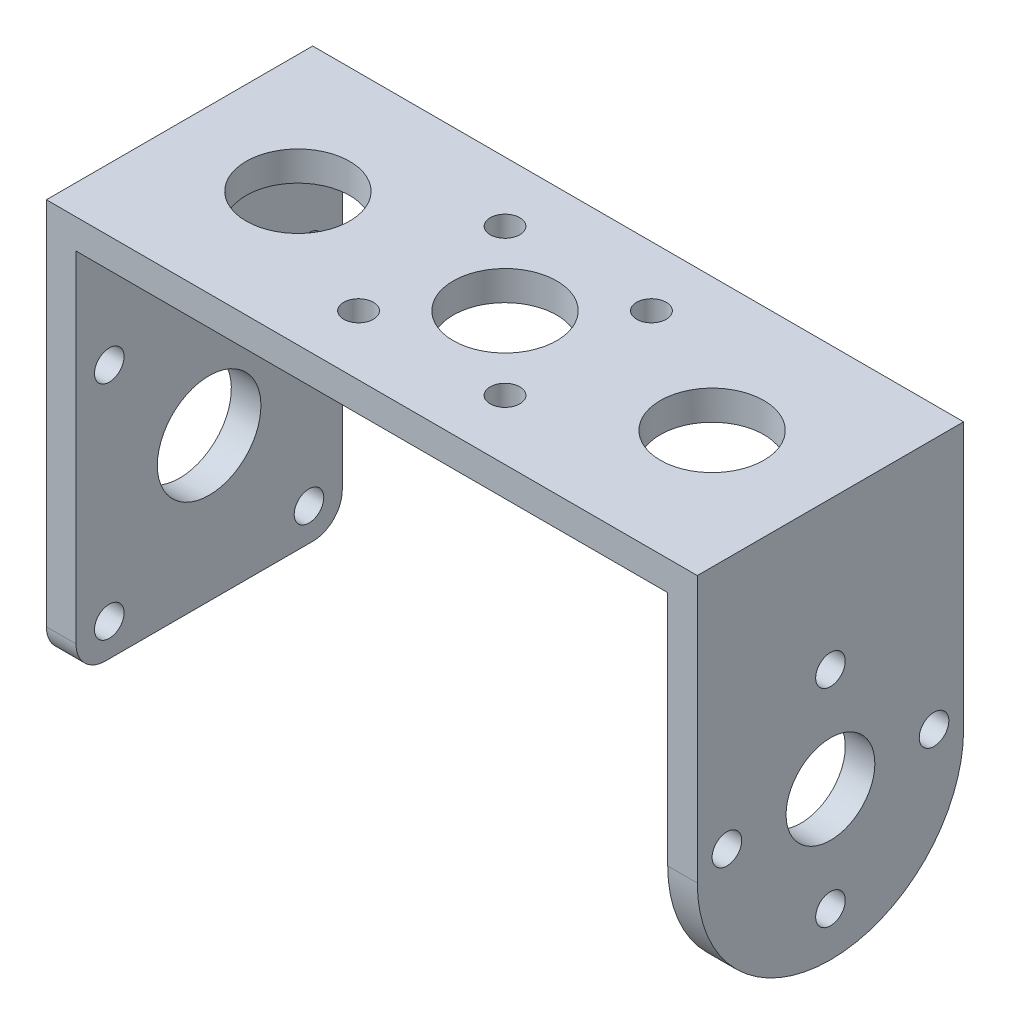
ISO-10303-21;
HEADER;
FILE_DESCRIPTION(('STEP AP214'),'2;1');
FILE_NAME('part.step','',(''),(''),'','','');
FILE_SCHEMA(('AUTOMOTIVE_DESIGN { 1 0 10303 214 1 1 1 1 }'));
ENDSEC;
DATA;
#1=APPLICATION_CONTEXT('core data for automotive mechanical design processes');
#2=APPLICATION_PROTOCOL_DEFINITION('international standard','automotive_design',2000,#1);
#3=PRODUCT_CONTEXT('',#1,'mechanical');
#4=PRODUCT('Part','Part','',(#3));
#5=PRODUCT_RELATED_PRODUCT_CATEGORY('part','',(#4));
#6=PRODUCT_DEFINITION_FORMATION('','',#4);
#7=PRODUCT_DEFINITION_CONTEXT('part definition',#1,'design');
#8=PRODUCT_DEFINITION('design','',#6,#7);
#9=PRODUCT_DEFINITION_SHAPE('','',#8);
#10=(LENGTH_UNIT() NAMED_UNIT(*) SI_UNIT(.MILLI.,.METRE.));
#11=(NAMED_UNIT(*) PLANE_ANGLE_UNIT() SI_UNIT($,.RADIAN.));
#12=(NAMED_UNIT(*) SI_UNIT($,.STERADIAN.) SOLID_ANGLE_UNIT());
#13=UNCERTAINTY_MEASURE_WITH_UNIT(LENGTH_MEASURE(1.E-05),#10,'distance_accuracy_value','');
#14=(GEOMETRIC_REPRESENTATION_CONTEXT(3) GLOBAL_UNCERTAINTY_ASSIGNED_CONTEXT((#13)) GLOBAL_UNIT_ASSIGNED_CONTEXT((#10,
#11,#12)) REPRESENTATION_CONTEXT('',''));
#15=CARTESIAN_POINT('',(0.,0.,0.));
#16=DIRECTION('',(0.,0.,1.));
#17=DIRECTION('',(1.,0.,0.));
#18=AXIS2_PLACEMENT_3D('',#15,#16,#17);
#19=CARTESIAN_POINT('',(22.,13.5,18.));
#20=DIRECTION('',(-1.,0.,0.));
#21=DIRECTION('',(0.,-1.,0.));
#22=AXIS2_PLACEMENT_3D('',#19,#20,#21);
#23=PLANE('',#22);
#24=CARTESIAN_POINT('',(22.,-3.50000000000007,2.));
#25=DIRECTION('',(1.,0.,0.));
#26=DIRECTION('',(0.,1.,0.));
#27=AXIS2_PLACEMENT_3D('',#24,#25,#26);
#28=CIRCLE('',#27,1.);
#29=CARTESIAN_POINT('',(22.,-2.50000000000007,2.));
#30=VERTEX_POINT('',#29);
#31=EDGE_CURVE('E277',#30,#30,#28,.T.);
#32=ORIENTED_EDGE('',*,*,#31,.F.);
#33=EDGE_LOOP('',(#32));
#34=FACE_BOUND('',#33,.T.);
#35=CARTESIAN_POINT('',(22.,3.5,8.99999999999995));
#36=DIRECTION('',(1.,0.,0.));
#37=DIRECTION('',(0.,1.,0.));
#38=AXIS2_PLACEMENT_3D('',#35,#36,#37);
#39=CIRCLE('',#38,1.);
#40=CARTESIAN_POINT('',(22.,4.5,8.99999999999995));
#41=VERTEX_POINT('',#40);
#42=EDGE_CURVE('E283',#41,#41,#39,.T.);
#43=ORIENTED_EDGE('',*,*,#42,.F.);
#44=EDGE_LOOP('',(#43));
#45=FACE_BOUND('',#44,.T.);
#46=CARTESIAN_POINT('',(22.,-3.49999999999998,16.));
#47=DIRECTION('',(1.,0.,0.));
#48=DIRECTION('',(0.,1.,0.));
#49=AXIS2_PLACEMENT_3D('',#46,#47,#48);
#50=CIRCLE('',#49,1.);
#51=CARTESIAN_POINT('',(22.,-2.49999999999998,16.));
#52=VERTEX_POINT('',#51);
#53=EDGE_CURVE('E289',#52,#52,#50,.T.);
#54=ORIENTED_EDGE('',*,*,#53,.F.);
#55=EDGE_LOOP('',(#54));
#56=FACE_BOUND('',#55,.T.);
#57=CARTESIAN_POINT('',(22.,-10.5,9.));
#58=DIRECTION('',(1.,0.,0.));
#59=DIRECTION('',(0.,1.,0.));
#60=AXIS2_PLACEMENT_3D('',#57,#58,#59);
#61=CIRCLE('',#60,1.);
#62=CARTESIAN_POINT('',(22.,-9.5,9.));
#63=VERTEX_POINT('',#62);
#64=EDGE_CURVE('E295',#63,#63,#61,.T.);
#65=ORIENTED_EDGE('',*,*,#64,.F.);
#66=EDGE_LOOP('',(#65));
#67=FACE_BOUND('',#66,.T.);
#68=CARTESIAN_POINT('',(22.,-3.5,9.));
#69=DIRECTION('',(1.,0.,0.));
#70=DIRECTION('',(0.,1.,0.));
#71=AXIS2_PLACEMENT_3D('',#68,#69,#70);
#72=CIRCLE('',#71,3.);
#73=CARTESIAN_POINT('',(22.,-0.499999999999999,9.));
#74=VERTEX_POINT('',#73);
#75=EDGE_CURVE('E201',#74,#74,#72,.T.);
#76=ORIENTED_EDGE('',*,*,#75,.F.);
#77=EDGE_LOOP('',(#76));
#78=FACE_BOUND('',#77,.T.);
#79=CARTESIAN_POINT('',(22.,-4.5,9.));
#80=DIRECTION('',(-1.,0.,0.));
#81=DIRECTION('',(0.,-1.,0.));
#82=AXIS2_PLACEMENT_3D('',#79,#80,#81);
#83=CIRCLE('',#82,9.);
#84=CARTESIAN_POINT('',(22.,-4.5,18.));
#85=VERTEX_POINT('',#84);
#86=CARTESIAN_POINT('',(22.,-13.5,9.));
#87=VERTEX_POINT('',#86);
#88=EDGE_CURVE('E146',#85,#87,#83,.F.);
#89=ORIENTED_EDGE('',*,*,#88,.T.);
#90=CARTESIAN_POINT('',(22.,-4.5,9.));
#91=DIRECTION('',(-1.,0.,0.));
#92=DIRECTION('',(0.,-1.,0.));
#93=AXIS2_PLACEMENT_3D('',#90,#91,#92);
#94=CIRCLE('',#93,9.);
#95=CARTESIAN_POINT('',(22.,-4.5,0.));
#96=VERTEX_POINT('',#95);
#97=EDGE_CURVE('E188',#87,#96,#94,.F.);
#98=ORIENTED_EDGE('',*,*,#97,.T.);
#99=DIRECTION('',(0.,1.,0.));
#100=VECTOR('',#99,1.);
#101=CARTESIAN_POINT('',(22.,13.5,0.));
#102=LINE('',#101,#100);
#103=CARTESIAN_POINT('',(22.,13.5,0.));
#104=VERTEX_POINT('',#103);
#105=EDGE_CURVE('E143',#96,#104,#102,.T.);
#106=ORIENTED_EDGE('',*,*,#105,.T.);
#107=DIRECTION('',(0.,0.,-1.));
#108=VECTOR('',#107,1.);
#109=CARTESIAN_POINT('',(22.,13.5,18.));
#110=LINE('',#109,#108);
#111=CARTESIAN_POINT('',(22.,13.5,18.));
#112=VERTEX_POINT('',#111);
#113=EDGE_CURVE('E141',#112,#104,#110,.T.);
#114=ORIENTED_EDGE('',*,*,#113,.F.);
#115=DIRECTION('',(0.,1.,0.));
#116=VECTOR('',#115,1.);
#117=CARTESIAN_POINT('',(22.,13.5,18.));
#118=LINE('',#117,#116);
#119=EDGE_CURVE('E127',#85,#112,#118,.T.);
#120=ORIENTED_EDGE('',*,*,#119,.F.);
#121=EDGE_LOOP('',(#89,#98,#106,#114,#120));
#122=FACE_BOUND('',#121,.T.);
#123=ADVANCED_FACE('F39',(#34,#45,#56,#67,#78,#122),#23,.F.);
#124=CARTESIAN_POINT('',(-22.,13.5,18.));
#125=DIRECTION('',(0.,-1.,0.));
#126=DIRECTION('',(0.,0.,-1.));
#127=AXIS2_PLACEMENT_3D('',#124,#125,#126);
#128=PLANE('',#127);
#129=CARTESIAN_POINT('',(14.,13.5,9.));
#130=DIRECTION('',(0.,1.,0.));
#131=DIRECTION('',(0.,0.,-1.));
#132=AXIS2_PLACEMENT_3D('',#129,#130,#131);
#133=CIRCLE('',#132,3.5);
#134=CARTESIAN_POINT('',(14.,13.5,5.5));
#135=VERTEX_POINT('',#134);
#136=EDGE_CURVE('E576',#135,#135,#133,.T.);
#137=ORIENTED_EDGE('',*,*,#136,.F.);
#138=EDGE_LOOP('',(#137));
#139=FACE_BOUND('',#138,.T.);
#140=CARTESIAN_POINT('',(-14.,13.5,9.));
#141=DIRECTION('',(0.,1.,0.));
#142=DIRECTION('',(0.,0.,1.));
#143=AXIS2_PLACEMENT_3D('',#140,#141,#142);
#144=CIRCLE('',#143,3.5);
#145=CARTESIAN_POINT('',(-14.,13.5,12.5));
#146=VERTEX_POINT('',#145);
#147=EDGE_CURVE('E580',#146,#146,#144,.T.);
#148=ORIENTED_EDGE('',*,*,#147,.F.);
#149=EDGE_LOOP('',(#148));
#150=FACE_BOUND('',#149,.T.);
#151=CARTESIAN_POINT('',(4.94974746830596,13.5,13.9497474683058));
#152=DIRECTION('',(0.,1.,0.));
#153=DIRECTION('',(0.,0.,1.));
#154=AXIS2_PLACEMENT_3D('',#151,#152,#153);
#155=CIRCLE('',#154,1.);
#156=CARTESIAN_POINT('',(4.94974746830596,13.5,14.9497474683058));
#157=VERTEX_POINT('',#156);
#158=EDGE_CURVE('E237',#157,#157,#155,.T.);
#159=ORIENTED_EDGE('',*,*,#158,.F.);
#160=EDGE_LOOP('',(#159));
#161=FACE_BOUND('',#160,.T.);
#162=CARTESIAN_POINT('',(-4.94974746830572,13.5,13.9497474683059));
#163=DIRECTION('',(0.,1.,0.));
#164=DIRECTION('',(0.,0.,1.));
#165=AXIS2_PLACEMENT_3D('',#162,#163,#164);
#166=CIRCLE('',#165,1.);
#167=CARTESIAN_POINT('',(-4.94974746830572,13.5,14.9497474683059));
#168=VERTEX_POINT('',#167);
#169=EDGE_CURVE('E227',#168,#168,#166,.T.);
#170=ORIENTED_EDGE('',*,*,#169,.F.);
#171=EDGE_LOOP('',(#170));
#172=FACE_BOUND('',#171,.T.);
#173=CARTESIAN_POINT('',(-4.94974746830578,13.5,4.05025253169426));
#174=DIRECTION('',(0.,1.,0.));
#175=DIRECTION('',(0.,0.,1.));
#176=AXIS2_PLACEMENT_3D('',#173,#174,#175);
#177=CIRCLE('',#176,1.);
#178=CARTESIAN_POINT('',(-4.94974746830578,13.5,5.05025253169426));
#179=VERTEX_POINT('',#178);
#180=EDGE_CURVE('E224',#179,#179,#177,.T.);
#181=ORIENTED_EDGE('',*,*,#180,.F.);
#182=EDGE_LOOP('',(#181));
#183=FACE_BOUND('',#182,.T.);
#184=CARTESIAN_POINT('',(0.,13.5,8.99999999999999));
#185=DIRECTION('',(0.,1.,0.));
#186=DIRECTION('',(0.,0.,1.));
#187=AXIS2_PLACEMENT_3D('',#184,#185,#186);
#188=CIRCLE('',#187,3.5);
#189=CARTESIAN_POINT('',(0.,13.5,12.5));
#190=VERTEX_POINT('',#189);
#191=EDGE_CURVE('E221',#190,#190,#188,.T.);
#192=ORIENTED_EDGE('',*,*,#191,.F.);
#193=EDGE_LOOP('',(#192));
#194=FACE_BOUND('',#193,.T.);
#195=CARTESIAN_POINT('',(4.94974746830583,13.5,4.05025253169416));
#196=DIRECTION('',(0.,1.,0.));
#197=DIRECTION('',(0.,0.,1.));
#198=AXIS2_PLACEMENT_3D('',#195,#196,#197);
#199=CIRCLE('',#198,1.);
#200=CARTESIAN_POINT('',(4.94974746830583,13.5,5.05025253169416));
#201=VERTEX_POINT('',#200);
#202=EDGE_CURVE('E217',#201,#201,#199,.T.);
#203=ORIENTED_EDGE('',*,*,#202,.F.);
#204=EDGE_LOOP('',(#203));
#205=FACE_BOUND('',#204,.T.);
#206=DIRECTION('',(-1.,0.,0.));
#207=VECTOR('',#206,1.);
#208=CARTESIAN_POINT('',(-22.,13.5,0.));
#209=LINE('',#208,#207);
#210=CARTESIAN_POINT('',(-22.,13.5,0.));
#211=VERTEX_POINT('',#210);
#212=EDGE_CURVE('E164',#104,#211,#209,.T.);
#213=ORIENTED_EDGE('',*,*,#212,.T.);
#214=DIRECTION('',(0.,0.,-1.));
#215=VECTOR('',#214,1.);
#216=CARTESIAN_POINT('',(-22.,13.5,18.));
#217=LINE('',#216,#215);
#218=CARTESIAN_POINT('',(-22.,13.5,18.));
#219=VERTEX_POINT('',#218);
#220=EDGE_CURVE('E147',#219,#211,#217,.T.);
#221=ORIENTED_EDGE('',*,*,#220,.F.);
#222=DIRECTION('',(-1.,0.,0.));
#223=VECTOR('',#222,1.);
#224=CARTESIAN_POINT('',(-22.,13.5,18.));
#225=LINE('',#224,#223);
#226=EDGE_CURVE('E131',#112,#219,#225,.T.);
#227=ORIENTED_EDGE('',*,*,#226,.F.);
#228=ORIENTED_EDGE('',*,*,#113,.T.);
#229=EDGE_LOOP('',(#213,#221,#227,#228));
#230=FACE_BOUND('',#229,.T.);
#231=ADVANCED_FACE('F149',(#139,#150,#161,#172,#183,#194,#205,#230),#128,.F.);
#232=CARTESIAN_POINT('',(-22.,13.5,18.));
#233=DIRECTION('',(1.,0.,0.));
#234=DIRECTION('',(0.,1.,0.));
#235=AXIS2_PLACEMENT_3D('',#232,#233,#234);
#236=PLANE('',#235);
#237=CARTESIAN_POINT('',(-22.,-11.3000000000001,2.25000000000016));
#238=DIRECTION('',(-1.,0.,0.));
#239=DIRECTION('',(0.,-1.,0.));
#240=AXIS2_PLACEMENT_3D('',#237,#238,#239);
#241=CIRCLE('',#240,1.);
#242=CARTESIAN_POINT('',(-22.,-12.3000000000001,2.25000000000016));
#243=VERTEX_POINT('',#242);
#244=EDGE_CURVE('E216',#243,#243,#241,.T.);
#245=ORIENTED_EDGE('',*,*,#244,.F.);
#246=EDGE_LOOP('',(#245));
#247=FACE_BOUND('',#246,.T.);
#248=CARTESIAN_POINT('',(-22.,-11.3,15.7500000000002));
#249=DIRECTION('',(-1.,0.,0.));
#250=DIRECTION('',(0.,-1.,0.));
#251=AXIS2_PLACEMENT_3D('',#248,#249,#250);
#252=CIRCLE('',#251,1.);
#253=CARTESIAN_POINT('',(-22.,-12.3,15.7500000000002));
#254=VERTEX_POINT('',#253);
#255=EDGE_CURVE('E248',#254,#254,#252,.T.);
#256=ORIENTED_EDGE('',*,*,#255,.F.);
#257=EDGE_LOOP('',(#256));
#258=FACE_BOUND('',#257,.T.);
#259=CARTESIAN_POINT('',(-22.,3.7,15.75));
#260=DIRECTION('',(-1.,0.,0.));
#261=DIRECTION('',(0.,-1.,0.));
#262=AXIS2_PLACEMENT_3D('',#259,#260,#261);
#263=CIRCLE('',#262,1.);
#264=CARTESIAN_POINT('',(-22.,2.7,15.75));
#265=VERTEX_POINT('',#264);
#266=EDGE_CURVE('E254',#265,#265,#263,.T.);
#267=ORIENTED_EDGE('',*,*,#266,.F.);
#268=EDGE_LOOP('',(#267));
#269=FACE_BOUND('',#268,.T.);
#270=CARTESIAN_POINT('',(-22.,3.6999999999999,2.25));
#271=DIRECTION('',(-1.,0.,0.));
#272=DIRECTION('',(0.,-1.,0.));
#273=AXIS2_PLACEMENT_3D('',#270,#271,#272);
#274=CIRCLE('',#273,1.);
#275=CARTESIAN_POINT('',(-22.,2.6999999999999,2.25));
#276=VERTEX_POINT('',#275);
#277=EDGE_CURVE('E262',#276,#276,#274,.T.);
#278=ORIENTED_EDGE('',*,*,#277,.F.);
#279=EDGE_LOOP('',(#278));
#280=FACE_BOUND('',#279,.T.);
#281=CARTESIAN_POINT('',(-22.,-3.8,9.));
#282=DIRECTION('',(-1.,0.,0.));
#283=DIRECTION('',(0.,-1.,0.));
#284=AXIS2_PLACEMENT_3D('',#281,#282,#283);
#285=CIRCLE('',#284,3.5);
#286=CARTESIAN_POINT('',(-22.,-7.3,9.));
#287=VERTEX_POINT('',#286);
#288=EDGE_CURVE('E271',#287,#287,#285,.T.);
#289=ORIENTED_EDGE('',*,*,#288,.F.);
#290=EDGE_LOOP('',(#289));
#291=FACE_BOUND('',#290,.T.);
#292=DIRECTION('',(0.,-1.,0.));
#293=VECTOR('',#292,1.);
#294=CARTESIAN_POINT('',(-22.,13.5,0.));
#295=LINE('',#294,#293);
#296=CARTESIAN_POINT('',(-22.,-11.5,0.));
#297=VERTEX_POINT('',#296);
#298=EDGE_CURVE('E167',#211,#297,#295,.T.);
#299=ORIENTED_EDGE('',*,*,#298,.T.);
#300=CARTESIAN_POINT('',(-22.,-11.5,2.));
#301=DIRECTION('',(1.,0.,0.));
#302=DIRECTION('',(0.,1.,0.));
#303=AXIS2_PLACEMENT_3D('',#300,#301,#302);
#304=CIRCLE('',#303,2.);
#305=CARTESIAN_POINT('',(-22.,-13.5,2.));
#306=VERTEX_POINT('',#305);
#307=EDGE_CURVE('E48',#297,#306,#304,.F.);
#308=ORIENTED_EDGE('',*,*,#307,.T.);
#309=DIRECTION('',(0.,0.,-1.));
#310=VECTOR('',#309,1.);
#311=CARTESIAN_POINT('',(-22.,-13.5,18.));
#312=LINE('',#311,#310);
#313=CARTESIAN_POINT('',(-22.,-13.5,16.));
#314=VERTEX_POINT('',#313);
#315=EDGE_CURVE('E183',#314,#306,#312,.T.);
#316=ORIENTED_EDGE('',*,*,#315,.F.);
#317=CARTESIAN_POINT('',(-22.,-11.5,16.));
#318=DIRECTION('',(1.,0.,0.));
#319=DIRECTION('',(0.,1.,0.));
#320=AXIS2_PLACEMENT_3D('',#317,#318,#319);
#321=CIRCLE('',#320,2.);
#322=CARTESIAN_POINT('',(-22.,-11.5,18.));
#323=VERTEX_POINT('',#322);
#324=EDGE_CURVE('E56',#314,#323,#321,.F.);
#325=ORIENTED_EDGE('',*,*,#324,.T.);
#326=DIRECTION('',(0.,-1.,0.));
#327=VECTOR('',#326,1.);
#328=CARTESIAN_POINT('',(-22.,13.5,18.));
#329=LINE('',#328,#327);
#330=EDGE_CURVE('E151',#219,#323,#329,.T.);
#331=ORIENTED_EDGE('',*,*,#330,.F.);
#332=ORIENTED_EDGE('',*,*,#220,.T.);
#333=EDGE_LOOP('',(#299,#308,#316,#325,#331,#332));
#334=FACE_BOUND('',#333,.T.);
#335=ADVANCED_FACE('F313',(#247,#258,#269,#280,#291,#334),#236,.F.);
#336=CARTESIAN_POINT('',(-22.,-13.5,18.));
#337=DIRECTION('',(0.,1.,0.));
#338=DIRECTION('',(-1.,0.,0.));
#339=AXIS2_PLACEMENT_3D('',#336,#337,#338);
#340=PLANE('',#339);
#341=ORIENTED_EDGE('',*,*,#315,.T.);
#342=DIRECTION('',(1.,0.,0.));
#343=VECTOR('',#342,1.);
#344=CARTESIAN_POINT('',(-20.,-13.5,2.));
#345=LINE('',#344,#343);
#346=CARTESIAN_POINT('',(-20.,-13.5,2.));
#347=VERTEX_POINT('',#346);
#348=EDGE_CURVE('E203',#306,#347,#345,.T.);
#349=ORIENTED_EDGE('',*,*,#348,.T.);
#350=DIRECTION('',(0.,0.,-1.));
#351=VECTOR('',#350,1.);
#352=CARTESIAN_POINT('',(-20.,-13.5,18.));
#353=LINE('',#352,#351);
#354=CARTESIAN_POINT('',(-20.,-13.5,16.));
#355=VERTEX_POINT('',#354);
#356=EDGE_CURVE('E180',#355,#347,#353,.T.);
#357=ORIENTED_EDGE('',*,*,#356,.F.);
#358=DIRECTION('',(1.,0.,0.));
#359=VECTOR('',#358,1.);
#360=CARTESIAN_POINT('',(-22.,-13.5,16.));
#361=LINE('',#360,#359);
#362=EDGE_CURVE('E198',#355,#314,#361,.F.);
#363=ORIENTED_EDGE('',*,*,#362,.T.);
#364=EDGE_LOOP('',(#341,#349,#357,#363));
#365=FACE_BOUND('',#364,.T.);
#366=ADVANCED_FACE('F338',(#365),#340,.F.);
#367=CARTESIAN_POINT('',(-20.,-13.5,18.));
#368=DIRECTION('',(-1.,0.,0.));
#369=DIRECTION('',(0.,0.,1.));
#370=AXIS2_PLACEMENT_3D('',#367,#368,#369);
#371=PLANE('',#370);
#372=CARTESIAN_POINT('',(-20.,-11.3000000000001,2.25000000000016));
#373=DIRECTION('',(-1.,0.,0.));
#374=DIRECTION('',(0.,0.,1.));
#375=AXIS2_PLACEMENT_3D('',#372,#373,#374);
#376=CIRCLE('',#375,1.);
#377=CARTESIAN_POINT('',(-20.,-11.3000000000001,3.25000000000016));
#378=VERTEX_POINT('',#377);
#379=EDGE_CURVE('E245',#378,#378,#376,.F.);
#380=ORIENTED_EDGE('',*,*,#379,.F.);
#381=EDGE_LOOP('',(#380));
#382=FACE_BOUND('',#381,.T.);
#383=CARTESIAN_POINT('',(-20.,-11.3,15.7500000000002));
#384=DIRECTION('',(-1.,0.,0.));
#385=DIRECTION('',(0.,0.,1.));
#386=AXIS2_PLACEMENT_3D('',#383,#384,#385);
#387=CIRCLE('',#386,1.);
#388=CARTESIAN_POINT('',(-20.,-11.3,16.7500000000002));
#389=VERTEX_POINT('',#388);
#390=EDGE_CURVE('E251',#389,#389,#387,.F.);
#391=ORIENTED_EDGE('',*,*,#390,.F.);
#392=EDGE_LOOP('',(#391));
#393=FACE_BOUND('',#392,.T.);
#394=CARTESIAN_POINT('',(-20.,3.7,15.75));
#395=DIRECTION('',(-1.,0.,0.));
#396=DIRECTION('',(0.,0.,1.));
#397=AXIS2_PLACEMENT_3D('',#394,#395,#396);
#398=CIRCLE('',#397,1.);
#399=CARTESIAN_POINT('',(-20.,3.7,16.75));
#400=VERTEX_POINT('',#399);
#401=EDGE_CURVE('E259',#400,#400,#398,.F.);
#402=ORIENTED_EDGE('',*,*,#401,.F.);
#403=EDGE_LOOP('',(#402));
#404=FACE_BOUND('',#403,.T.);
#405=CARTESIAN_POINT('',(-20.,3.6999999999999,2.25));
#406=DIRECTION('',(-1.,0.,0.));
#407=DIRECTION('',(0.,0.,1.));
#408=AXIS2_PLACEMENT_3D('',#405,#406,#407);
#409=CIRCLE('',#408,1.);
#410=CARTESIAN_POINT('',(-20.,3.6999999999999,3.25));
#411=VERTEX_POINT('',#410);
#412=EDGE_CURVE('E265',#411,#411,#409,.F.);
#413=ORIENTED_EDGE('',*,*,#412,.F.);
#414=EDGE_LOOP('',(#413));
#415=FACE_BOUND('',#414,.T.);
#416=CARTESIAN_POINT('',(-20.,-3.8,9.));
#417=DIRECTION('',(-1.,0.,0.));
#418=DIRECTION('',(0.,0.,1.));
#419=AXIS2_PLACEMENT_3D('',#416,#417,#418);
#420=CIRCLE('',#419,3.5);
#421=CARTESIAN_POINT('',(-20.,-3.8,12.5));
#422=VERTEX_POINT('',#421);
#423=EDGE_CURVE('E268',#422,#422,#420,.F.);
#424=ORIENTED_EDGE('',*,*,#423,.F.);
#425=EDGE_LOOP('',(#424));
#426=FACE_BOUND('',#425,.T.);
#427=ORIENTED_EDGE('',*,*,#356,.T.);
#428=CARTESIAN_POINT('',(-20.,-11.5,2.));
#429=DIRECTION('',(-1.,0.,0.));
#430=DIRECTION('',(0.,0.,1.));
#431=AXIS2_PLACEMENT_3D('',#428,#429,#430);
#432=CIRCLE('',#431,2.);
#433=CARTESIAN_POINT('',(-20.,-11.5,0.));
#434=VERTEX_POINT('',#433);
#435=EDGE_CURVE('E208',#347,#434,#432,.F.);
#436=ORIENTED_EDGE('',*,*,#435,.T.);
#437=DIRECTION('',(0.,1.,0.));
#438=VECTOR('',#437,1.);
#439=CARTESIAN_POINT('',(-20.,-13.5,0.));
#440=LINE('',#439,#438);
#441=CARTESIAN_POINT('',(-20.,11.5,0.));
#442=VERTEX_POINT('',#441);
#443=EDGE_CURVE('E169',#434,#442,#440,.T.);
#444=ORIENTED_EDGE('',*,*,#443,.T.);
#445=DIRECTION('',(0.,0.,-1.));
#446=VECTOR('',#445,1.);
#447=CARTESIAN_POINT('',(-20.,11.5,18.));
#448=LINE('',#447,#446);
#449=CARTESIAN_POINT('',(-20.,11.5,18.));
#450=VERTEX_POINT('',#449);
#451=EDGE_CURVE('E177',#450,#442,#448,.T.);
#452=ORIENTED_EDGE('',*,*,#451,.F.);
#453=DIRECTION('',(0.,1.,0.));
#454=VECTOR('',#453,1.);
#455=CARTESIAN_POINT('',(-20.,-13.5,18.));
#456=LINE('',#455,#454);
#457=CARTESIAN_POINT('',(-20.,-11.5,18.));
#458=VERTEX_POINT('',#457);
#459=EDGE_CURVE('E153',#458,#450,#456,.T.);
#460=ORIENTED_EDGE('',*,*,#459,.F.);
#461=CARTESIAN_POINT('',(-20.,-11.5,16.));
#462=DIRECTION('',(-1.,0.,0.));
#463=DIRECTION('',(0.,0.,1.));
#464=AXIS2_PLACEMENT_3D('',#461,#462,#463);
#465=CIRCLE('',#464,2.);
#466=EDGE_CURVE('E206',#458,#355,#465,.F.);
#467=ORIENTED_EDGE('',*,*,#466,.T.);
#468=EDGE_LOOP('',(#427,#436,#444,#452,#460,#467));
#469=FACE_BOUND('',#468,.T.);
#470=ADVANCED_FACE('F345',(#382,#393,#404,#415,#426,#469),#371,.F.);
#471=CARTESIAN_POINT('',(-20.,11.5,18.));
#472=DIRECTION('',(0.,1.,0.));
#473=DIRECTION('',(0.,0.,1.));
#474=AXIS2_PLACEMENT_3D('',#471,#472,#473);
#475=PLANE('',#474);
#476=CARTESIAN_POINT('',(14.,11.5,9.));
#477=DIRECTION('',(0.,1.,0.));
#478=DIRECTION('',(0.,0.,1.));
#479=AXIS2_PLACEMENT_3D('',#476,#477,#478);
#480=CIRCLE('',#479,3.5);
#481=CARTESIAN_POINT('',(14.,11.5,12.5));
#482=VERTEX_POINT('',#481);
#483=EDGE_CURVE('E579',#482,#482,#480,.F.);
#484=ORIENTED_EDGE('',*,*,#483,.F.);
#485=EDGE_LOOP('',(#484));
#486=FACE_BOUND('',#485,.T.);
#487=CARTESIAN_POINT('',(-14.,11.5,9.));
#488=DIRECTION('',(0.,1.,0.));
#489=DIRECTION('',(0.,0.,1.));
#490=AXIS2_PLACEMENT_3D('',#487,#488,#489);
#491=CIRCLE('',#490,3.5);
#492=CARTESIAN_POINT('',(-14.,11.5,12.5));
#493=VERTEX_POINT('',#492);
#494=EDGE_CURVE('E583',#493,#493,#491,.F.);
#495=ORIENTED_EDGE('',*,*,#494,.F.);
#496=EDGE_LOOP('',(#495));
#497=FACE_BOUND('',#496,.T.);
#498=CARTESIAN_POINT('',(4.94974746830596,11.5,13.9497474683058));
#499=DIRECTION('',(0.,1.,0.));
#500=DIRECTION('',(0.,0.,1.));
#501=AXIS2_PLACEMENT_3D('',#498,#499,#500);
#502=CIRCLE('',#501,1.);
#503=CARTESIAN_POINT('',(4.94974746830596,11.5,14.9497474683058));
#504=VERTEX_POINT('',#503);
#505=EDGE_CURVE('E43',#504,#504,#502,.T.);
#506=ORIENTED_EDGE('',*,*,#505,.T.);
#507=EDGE_LOOP('',(#506));
#508=FACE_BOUND('',#507,.T.);
#509=CARTESIAN_POINT('',(-4.94974746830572,11.5,13.9497474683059));
#510=DIRECTION('',(0.,1.,0.));
#511=DIRECTION('',(0.,0.,1.));
#512=AXIS2_PLACEMENT_3D('',#509,#510,#511);
#513=CIRCLE('',#512,1.);
#514=CARTESIAN_POINT('',(-4.94974746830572,11.5,14.9497474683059));
#515=VERTEX_POINT('',#514);
#516=EDGE_CURVE('E225',#515,#515,#513,.T.);
#517=ORIENTED_EDGE('',*,*,#516,.T.);
#518=EDGE_LOOP('',(#517));
#519=FACE_BOUND('',#518,.T.);
#520=CARTESIAN_POINT('',(-4.94974746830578,11.5,4.05025253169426));
#521=DIRECTION('',(0.,1.,0.));
#522=DIRECTION('',(0.,0.,1.));
#523=AXIS2_PLACEMENT_3D('',#520,#521,#522);
#524=CIRCLE('',#523,1.);
#525=CARTESIAN_POINT('',(-4.94974746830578,11.5,5.05025253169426));
#526=VERTEX_POINT('',#525);
#527=EDGE_CURVE('E222',#526,#526,#524,.T.);
#528=ORIENTED_EDGE('',*,*,#527,.T.);
#529=EDGE_LOOP('',(#528));
#530=FACE_BOUND('',#529,.T.);
#531=CARTESIAN_POINT('',(0.,11.5,8.99999999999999));
#532=DIRECTION('',(0.,1.,0.));
#533=DIRECTION('',(0.,0.,1.));
#534=AXIS2_PLACEMENT_3D('',#531,#532,#533);
#535=CIRCLE('',#534,3.5);
#536=CARTESIAN_POINT('',(0.,11.5,12.5));
#537=VERTEX_POINT('',#536);
#538=EDGE_CURVE('E218',#537,#537,#535,.T.);
#539=ORIENTED_EDGE('',*,*,#538,.T.);
#540=EDGE_LOOP('',(#539));
#541=FACE_BOUND('',#540,.T.);
#542=CARTESIAN_POINT('',(4.94974746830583,11.5,4.05025253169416));
#543=DIRECTION('',(0.,1.,0.));
#544=DIRECTION('',(0.,0.,1.));
#545=AXIS2_PLACEMENT_3D('',#542,#543,#544);
#546=CIRCLE('',#545,1.);
#547=CARTESIAN_POINT('',(4.94974746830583,11.5,5.05025253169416));
#548=VERTEX_POINT('',#547);
#549=EDGE_CURVE('E213',#548,#548,#546,.T.);
#550=ORIENTED_EDGE('',*,*,#549,.T.);
#551=EDGE_LOOP('',(#550));
#552=FACE_BOUND('',#551,.T.);
#553=DIRECTION('',(1.,0.,0.));
#554=VECTOR('',#553,1.);
#555=CARTESIAN_POINT('',(-20.,11.5,0.));
#556=LINE('',#555,#554);
#557=CARTESIAN_POINT('',(20.,11.5,0.));
#558=VERTEX_POINT('',#557);
#559=EDGE_CURVE('E171',#442,#558,#556,.T.);
#560=ORIENTED_EDGE('',*,*,#559,.T.);
#561=DIRECTION('',(0.,0.,-1.));
#562=VECTOR('',#561,1.);
#563=CARTESIAN_POINT('',(20.,11.5,18.));
#564=LINE('',#563,#562);
#565=CARTESIAN_POINT('',(20.,11.5,18.));
#566=VERTEX_POINT('',#565);
#567=EDGE_CURVE('E162',#566,#558,#564,.T.);
#568=ORIENTED_EDGE('',*,*,#567,.F.);
#569=DIRECTION('',(1.,0.,0.));
#570=VECTOR('',#569,1.);
#571=CARTESIAN_POINT('',(-20.,11.5,18.));
#572=LINE('',#571,#570);
#573=EDGE_CURVE('E158',#450,#566,#572,.T.);
#574=ORIENTED_EDGE('',*,*,#573,.F.);
#575=ORIENTED_EDGE('',*,*,#451,.T.);
#576=EDGE_LOOP('',(#560,#568,#574,#575));
#577=FACE_BOUND('',#576,.T.);
#578=ADVANCED_FACE('F350',(#486,#497,#508,#519,#530,#541,#552,#577),#475,.F.);
#579=CARTESIAN_POINT('',(20.,11.5,18.));
#580=DIRECTION('',(1.,0.,0.));
#581=DIRECTION('',(0.,1.,0.));
#582=AXIS2_PLACEMENT_3D('',#579,#580,#581);
#583=PLANE('',#582);
#584=CARTESIAN_POINT('',(20.,-3.50000000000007,2.));
#585=DIRECTION('',(1.,0.,0.));
#586=DIRECTION('',(0.,1.,0.));
#587=AXIS2_PLACEMENT_3D('',#584,#585,#586);
#588=CIRCLE('',#587,1.);
#589=CARTESIAN_POINT('',(20.,-2.50000000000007,2.));
#590=VERTEX_POINT('',#589);
#591=EDGE_CURVE('E274',#590,#590,#588,.F.);
#592=ORIENTED_EDGE('',*,*,#591,.F.);
#593=EDGE_LOOP('',(#592));
#594=FACE_BOUND('',#593,.T.);
#595=CARTESIAN_POINT('',(20.,3.5,8.99999999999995));
#596=DIRECTION('',(1.,0.,0.));
#597=DIRECTION('',(0.,1.,0.));
#598=AXIS2_PLACEMENT_3D('',#595,#596,#597);
#599=CIRCLE('',#598,1.);
#600=CARTESIAN_POINT('',(20.,4.5,8.99999999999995));
#601=VERTEX_POINT('',#600);
#602=EDGE_CURVE('E280',#601,#601,#599,.F.);
#603=ORIENTED_EDGE('',*,*,#602,.F.);
#604=EDGE_LOOP('',(#603));
#605=FACE_BOUND('',#604,.T.);
#606=CARTESIAN_POINT('',(20.,-3.49999999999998,16.));
#607=DIRECTION('',(1.,0.,0.));
#608=DIRECTION('',(0.,1.,0.));
#609=AXIS2_PLACEMENT_3D('',#606,#607,#608);
#610=CIRCLE('',#609,1.);
#611=CARTESIAN_POINT('',(20.,-2.49999999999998,16.));
#612=VERTEX_POINT('',#611);
#613=EDGE_CURVE('E286',#612,#612,#610,.F.);
#614=ORIENTED_EDGE('',*,*,#613,.F.);
#615=EDGE_LOOP('',(#614));
#616=FACE_BOUND('',#615,.T.);
#617=CARTESIAN_POINT('',(20.,-10.5,9.));
#618=DIRECTION('',(1.,0.,0.));
#619=DIRECTION('',(0.,1.,0.));
#620=AXIS2_PLACEMENT_3D('',#617,#618,#619);
#621=CIRCLE('',#620,1.);
#622=CARTESIAN_POINT('',(20.,-9.5,9.));
#623=VERTEX_POINT('',#622);
#624=EDGE_CURVE('E292',#623,#623,#621,.F.);
#625=ORIENTED_EDGE('',*,*,#624,.F.);
#626=EDGE_LOOP('',(#625));
#627=FACE_BOUND('',#626,.T.);
#628=CARTESIAN_POINT('',(20.,-3.5,9.));
#629=DIRECTION('',(1.,0.,0.));
#630=DIRECTION('',(0.,1.,0.));
#631=AXIS2_PLACEMENT_3D('',#628,#629,#630);
#632=CIRCLE('',#631,3.);
#633=CARTESIAN_POINT('',(20.,-0.499999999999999,9.));
#634=VERTEX_POINT('',#633);
#635=EDGE_CURVE('E298',#634,#634,#632,.F.);
#636=ORIENTED_EDGE('',*,*,#635,.F.);
#637=EDGE_LOOP('',(#636));
#638=FACE_BOUND('',#637,.T.);
#639=DIRECTION('',(0.,-1.,0.));
#640=VECTOR('',#639,1.);
#641=CARTESIAN_POINT('',(20.,11.5,0.));
#642=LINE('',#641,#640);
#643=CARTESIAN_POINT('',(20.,-4.5,0.));
#644=VERTEX_POINT('',#643);
#645=EDGE_CURVE('E138',#558,#644,#642,.T.);
#646=ORIENTED_EDGE('',*,*,#645,.T.);
#647=CARTESIAN_POINT('',(20.,-4.5,9.));
#648=DIRECTION('',(1.,0.,0.));
#649=DIRECTION('',(0.,1.,0.));
#650=AXIS2_PLACEMENT_3D('',#647,#648,#649);
#651=CIRCLE('',#650,9.);
#652=CARTESIAN_POINT('',(20.,-13.5,9.));
#653=VERTEX_POINT('',#652);
#654=EDGE_CURVE('E195',#644,#653,#651,.F.);
#655=ORIENTED_EDGE('',*,*,#654,.T.);
#656=CARTESIAN_POINT('',(20.,-4.5,9.));
#657=DIRECTION('',(1.,0.,0.));
#658=DIRECTION('',(0.,1.,0.));
#659=AXIS2_PLACEMENT_3D('',#656,#657,#658);
#660=CIRCLE('',#659,9.);
#661=CARTESIAN_POINT('',(20.,-4.5,18.));
#662=VERTEX_POINT('',#661);
#663=EDGE_CURVE('E193',#653,#662,#660,.F.);
#664=ORIENTED_EDGE('',*,*,#663,.T.);
#665=DIRECTION('',(0.,-1.,0.));
#666=VECTOR('',#665,1.);
#667=CARTESIAN_POINT('',(20.,11.5,18.));
#668=LINE('',#667,#666);
#669=EDGE_CURVE('E160',#566,#662,#668,.T.);
#670=ORIENTED_EDGE('',*,*,#669,.F.);
#671=ORIENTED_EDGE('',*,*,#567,.T.);
#672=EDGE_LOOP('',(#646,#655,#664,#670,#671));
#673=FACE_BOUND('',#672,.T.);
#674=ADVANCED_FACE('F358',(#594,#605,#616,#627,#638,#673),#583,.F.);
#675=CARTESIAN_POINT('',(0.,0.,18.));
#676=DIRECTION('',(0.,0.,-1.));
#677=DIRECTION('',(-1.,0.,0.));
#678=AXIS2_PLACEMENT_3D('',#675,#676,#677);
#679=PLANE('',#678);
#680=ORIENTED_EDGE('',*,*,#330,.T.);
#681=DIRECTION('',(1.,0.,0.));
#682=VECTOR('',#681,1.);
#683=CARTESIAN_POINT('',(0.,-11.5,18.));
#684=LINE('',#683,#682);
#685=EDGE_CURVE('E12',#323,#458,#684,.T.);
#686=ORIENTED_EDGE('',*,*,#685,.T.);
#687=ORIENTED_EDGE('',*,*,#459,.T.);
#688=ORIENTED_EDGE('',*,*,#573,.T.);
#689=ORIENTED_EDGE('',*,*,#669,.T.);
#690=DIRECTION('',(1.,0.,0.));
#691=VECTOR('',#690,1.);
#692=CARTESIAN_POINT('',(0.,-4.50000000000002,18.));
#693=LINE('',#692,#691);
#694=EDGE_CURVE('E135',#662,#85,#693,.T.);
#695=ORIENTED_EDGE('',*,*,#694,.T.);
#696=ORIENTED_EDGE('',*,*,#119,.T.);
#697=ORIENTED_EDGE('',*,*,#226,.T.);
#698=EDGE_LOOP('',(#680,#686,#687,#688,#689,#695,#696,#697));
#699=FACE_BOUND('',#698,.T.);
#700=ADVANCED_FACE('F129',(#699),#679,.F.);
#701=CARTESIAN_POINT('',(0.,0.,0.));
#702=DIRECTION('',(0.,0.,-1.));
#703=DIRECTION('',(-1.,0.,0.));
#704=AXIS2_PLACEMENT_3D('',#701,#702,#703);
#705=PLANE('',#704);
#706=ORIENTED_EDGE('',*,*,#443,.F.);
#707=DIRECTION('',(1.,0.,0.));
#708=VECTOR('',#707,1.);
#709=CARTESIAN_POINT('',(-22.,-11.5,0.));
#710=LINE('',#709,#708);
#711=EDGE_CURVE('E64',#434,#297,#710,.F.);
#712=ORIENTED_EDGE('',*,*,#711,.T.);
#713=ORIENTED_EDGE('',*,*,#298,.F.);
#714=ORIENTED_EDGE('',*,*,#212,.F.);
#715=ORIENTED_EDGE('',*,*,#105,.F.);
#716=DIRECTION('',(1.,0.,0.));
#717=VECTOR('',#716,1.);
#718=CARTESIAN_POINT('',(20.,-4.5,0.));
#719=LINE('',#718,#717);
#720=EDGE_CURVE('E190',#96,#644,#719,.F.);
#721=ORIENTED_EDGE('',*,*,#720,.T.);
#722=ORIENTED_EDGE('',*,*,#645,.F.);
#723=ORIENTED_EDGE('',*,*,#559,.F.);
#724=EDGE_LOOP('',(#706,#712,#713,#714,#715,#721,#722,#723));
#725=FACE_BOUND('',#724,.T.);
#726=ADVANCED_FACE('F327',(#725),#705,.T.);
#727=CARTESIAN_POINT('',(0.,-4.50000000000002,9.));
#728=DIRECTION('',(1.,0.,0.));
#729=DIRECTION('',(0.,1.,0.));
#730=AXIS2_PLACEMENT_3D('',#727,#728,#729);
#731=CYLINDRICAL_SURFACE('',#730,9.);
#732=ORIENTED_EDGE('',*,*,#694,.F.);
#733=ORIENTED_EDGE('',*,*,#663,.F.);
#734=DIRECTION('',(1.,0.,0.));
#735=VECTOR('',#734,1.);
#736=CARTESIAN_POINT('',(20.,-13.5,9.));
#737=LINE('',#736,#735);
#738=EDGE_CURVE('E165',#87,#653,#737,.F.);
#739=ORIENTED_EDGE('',*,*,#738,.F.);
#740=ORIENTED_EDGE('',*,*,#88,.F.);
#741=EDGE_LOOP('',(#732,#733,#739,#740));
#742=FACE_BOUND('',#741,.T.);
#743=ADVANCED_FACE('F324',(#742),#731,.T.);
#744=CARTESIAN_POINT('',(20.,-4.5,9.));
#745=DIRECTION('',(-1.,0.,0.));
#746=DIRECTION('',(0.,-1.,0.));
#747=AXIS2_PLACEMENT_3D('',#744,#745,#746);
#748=CYLINDRICAL_SURFACE('',#747,9.);
#749=ORIENTED_EDGE('',*,*,#654,.F.);
#750=ORIENTED_EDGE('',*,*,#720,.F.);
#751=ORIENTED_EDGE('',*,*,#97,.F.);
#752=ORIENTED_EDGE('',*,*,#738,.T.);
#753=EDGE_LOOP('',(#749,#750,#751,#752));
#754=FACE_BOUND('',#753,.T.);
#755=ADVANCED_FACE('F320',(#754),#748,.T.);
#756=CARTESIAN_POINT('',(-22.,-11.5,2.));
#757=DIRECTION('',(-1.,0.,0.));
#758=DIRECTION('',(0.,-1.,0.));
#759=AXIS2_PLACEMENT_3D('',#756,#757,#758);
#760=CYLINDRICAL_SURFACE('',#759,2.);
#761=ORIENTED_EDGE('',*,*,#307,.F.);
#762=ORIENTED_EDGE('',*,*,#711,.F.);
#763=ORIENTED_EDGE('',*,*,#435,.F.);
#764=ORIENTED_EDGE('',*,*,#348,.F.);
#765=EDGE_LOOP('',(#761,#762,#763,#764));
#766=FACE_BOUND('',#765,.T.);
#767=ADVANCED_FACE('F323',(#766),#760,.T.);
#768=CARTESIAN_POINT('',(0.,-11.5,16.));
#769=DIRECTION('',(1.,0.,0.));
#770=DIRECTION('',(0.,1.,0.));
#771=AXIS2_PLACEMENT_3D('',#768,#769,#770);
#772=CYLINDRICAL_SURFACE('',#771,2.);
#773=ORIENTED_EDGE('',*,*,#324,.F.);
#774=ORIENTED_EDGE('',*,*,#362,.F.);
#775=ORIENTED_EDGE('',*,*,#466,.F.);
#776=ORIENTED_EDGE('',*,*,#685,.F.);
#777=EDGE_LOOP('',(#773,#774,#775,#776));
#778=FACE_BOUND('',#777,.T.);
#779=ADVANCED_FACE('F41',(#778),#772,.T.);
#780=CARTESIAN_POINT('',(-22.001,-3.50000000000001,9.));
#781=DIRECTION('',(1.,0.,0.));
#782=DIRECTION('',(0.,1.,0.));
#783=AXIS2_PLACEMENT_3D('',#780,#781,#782);
#784=CYLINDRICAL_SURFACE('',#783,3.);
#785=ORIENTED_EDGE('',*,*,#75,.T.);
#786=EDGE_LOOP('',(#785));
#787=FACE_BOUND('',#786,.T.);
#788=ORIENTED_EDGE('',*,*,#635,.T.);
#789=EDGE_LOOP('',(#788));
#790=FACE_BOUND('',#789,.T.);
#791=ADVANCED_FACE('F303',(#787,#790),#784,.F.);
#792=CARTESIAN_POINT('',(-22.001,-10.5,9.));
#793=DIRECTION('',(1.,0.,0.));
#794=DIRECTION('',(0.,1.,0.));
#795=AXIS2_PLACEMENT_3D('',#792,#793,#794);
#796=CYLINDRICAL_SURFACE('',#795,1.);
#797=ORIENTED_EDGE('',*,*,#64,.T.);
#798=EDGE_LOOP('',(#797));
#799=FACE_BOUND('',#798,.T.);
#800=ORIENTED_EDGE('',*,*,#624,.T.);
#801=EDGE_LOOP('',(#800));
#802=FACE_BOUND('',#801,.T.);
#803=ADVANCED_FACE('F418',(#799,#802),#796,.F.);
#804=CARTESIAN_POINT('',(-22.001,-3.49999999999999,16.));
#805=DIRECTION('',(1.,0.,0.));
#806=DIRECTION('',(0.,1.,0.));
#807=AXIS2_PLACEMENT_3D('',#804,#805,#806);
#808=CYLINDRICAL_SURFACE('',#807,1.);
#809=ORIENTED_EDGE('',*,*,#53,.T.);
#810=EDGE_LOOP('',(#809));
#811=FACE_BOUND('',#810,.T.);
#812=ORIENTED_EDGE('',*,*,#613,.T.);
#813=EDGE_LOOP('',(#812));
#814=FACE_BOUND('',#813,.T.);
#815=ADVANCED_FACE('F414',(#811,#814),#808,.F.);
#816=CARTESIAN_POINT('',(-22.001,3.49999999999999,8.99999999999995));
#817=DIRECTION('',(1.,0.,0.));
#818=DIRECTION('',(0.,1.,0.));
#819=AXIS2_PLACEMENT_3D('',#816,#817,#818);
#820=CYLINDRICAL_SURFACE('',#819,1.);
#821=ORIENTED_EDGE('',*,*,#42,.T.);
#822=EDGE_LOOP('',(#821));
#823=FACE_BOUND('',#822,.T.);
#824=ORIENTED_EDGE('',*,*,#602,.T.);
#825=EDGE_LOOP('',(#824));
#826=FACE_BOUND('',#825,.T.);
#827=ADVANCED_FACE('F407',(#823,#826),#820,.F.);
#828=CARTESIAN_POINT('',(-22.001,-3.50000000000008,2.));
#829=DIRECTION('',(1.,0.,0.));
#830=DIRECTION('',(0.,1.,0.));
#831=AXIS2_PLACEMENT_3D('',#828,#829,#830);
#832=CYLINDRICAL_SURFACE('',#831,1.);
#833=ORIENTED_EDGE('',*,*,#31,.T.);
#834=EDGE_LOOP('',(#833));
#835=FACE_BOUND('',#834,.T.);
#836=ORIENTED_EDGE('',*,*,#591,.T.);
#837=EDGE_LOOP('',(#836));
#838=FACE_BOUND('',#837,.T.);
#839=ADVANCED_FACE('F396',(#835,#838),#832,.F.);
#840=CARTESIAN_POINT('',(22.001,-3.8,9.));
#841=DIRECTION('',(-1.,0.,0.));
#842=DIRECTION('',(0.,-1.,0.));
#843=AXIS2_PLACEMENT_3D('',#840,#841,#842);
#844=CYLINDRICAL_SURFACE('',#843,3.5);
#845=ORIENTED_EDGE('',*,*,#288,.T.);
#846=EDGE_LOOP('',(#845));
#847=FACE_BOUND('',#846,.T.);
#848=ORIENTED_EDGE('',*,*,#423,.T.);
#849=EDGE_LOOP('',(#848));
#850=FACE_BOUND('',#849,.T.);
#851=ADVANCED_FACE('F392',(#847,#850),#844,.F.);
#852=CARTESIAN_POINT('',(22.001,3.69999999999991,2.25));
#853=DIRECTION('',(-1.,0.,0.));
#854=DIRECTION('',(0.,-1.,0.));
#855=AXIS2_PLACEMENT_3D('',#852,#853,#854);
#856=CYLINDRICAL_SURFACE('',#855,1.);
#857=ORIENTED_EDGE('',*,*,#277,.T.);
#858=EDGE_LOOP('',(#857));
#859=FACE_BOUND('',#858,.T.);
#860=ORIENTED_EDGE('',*,*,#412,.T.);
#861=EDGE_LOOP('',(#860));
#862=FACE_BOUND('',#861,.T.);
#863=ADVANCED_FACE('F395',(#859,#862),#856,.F.);
#864=CARTESIAN_POINT('',(22.001,3.7,15.75));
#865=DIRECTION('',(-1.,0.,0.));
#866=DIRECTION('',(0.,-1.,0.));
#867=AXIS2_PLACEMENT_3D('',#864,#865,#866);
#868=CYLINDRICAL_SURFACE('',#867,1.);
#869=ORIENTED_EDGE('',*,*,#266,.T.);
#870=EDGE_LOOP('',(#869));
#871=FACE_BOUND('',#870,.T.);
#872=ORIENTED_EDGE('',*,*,#401,.T.);
#873=EDGE_LOOP('',(#872));
#874=FACE_BOUND('',#873,.T.);
#875=ADVANCED_FACE('F404',(#871,#874),#868,.F.);
#876=CARTESIAN_POINT('',(22.001,-11.3,15.7500000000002));
#877=DIRECTION('',(-1.,0.,0.));
#878=DIRECTION('',(0.,-1.,0.));
#879=AXIS2_PLACEMENT_3D('',#876,#877,#878);
#880=CYLINDRICAL_SURFACE('',#879,1.);
#881=ORIENTED_EDGE('',*,*,#255,.T.);
#882=EDGE_LOOP('',(#881));
#883=FACE_BOUND('',#882,.T.);
#884=ORIENTED_EDGE('',*,*,#390,.T.);
#885=EDGE_LOOP('',(#884));
#886=FACE_BOUND('',#885,.T.);
#887=ADVANCED_FACE('F476',(#883,#886),#880,.F.);
#888=CARTESIAN_POINT('',(22.001,-11.3000000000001,2.25000000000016));
#889=DIRECTION('',(-1.,0.,0.));
#890=DIRECTION('',(0.,-1.,0.));
#891=AXIS2_PLACEMENT_3D('',#888,#889,#890);
#892=CYLINDRICAL_SURFACE('',#891,1.);
#893=ORIENTED_EDGE('',*,*,#244,.T.);
#894=EDGE_LOOP('',(#893));
#895=FACE_BOUND('',#894,.T.);
#896=ORIENTED_EDGE('',*,*,#379,.T.);
#897=EDGE_LOOP('',(#896));
#898=FACE_BOUND('',#897,.T.);
#899=ADVANCED_FACE('F485',(#895,#898),#892,.F.);
#900=CARTESIAN_POINT('',(4.94974746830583,-6.5,4.05025253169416));
#901=DIRECTION('',(0.,1.,0.));
#902=DIRECTION('',(0.,0.,1.));
#903=AXIS2_PLACEMENT_3D('',#900,#901,#902);
#904=CYLINDRICAL_SURFACE('',#903,1.);
#905=ORIENTED_EDGE('',*,*,#202,.T.);
#906=EDGE_LOOP('',(#905));
#907=FACE_BOUND('',#906,.T.);
#908=ORIENTED_EDGE('',*,*,#549,.F.);
#909=EDGE_LOOP('',(#908));
#910=FACE_BOUND('',#909,.T.);
#911=ADVANCED_FACE('F495',(#907,#910),#904,.F.);
#912=CARTESIAN_POINT('',(0.,-6.5,8.99999999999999));
#913=DIRECTION('',(0.,1.,0.));
#914=DIRECTION('',(0.,0.,1.));
#915=AXIS2_PLACEMENT_3D('',#912,#913,#914);
#916=CYLINDRICAL_SURFACE('',#915,3.5);
#917=ORIENTED_EDGE('',*,*,#191,.T.);
#918=EDGE_LOOP('',(#917));
#919=FACE_BOUND('',#918,.T.);
#920=ORIENTED_EDGE('',*,*,#538,.F.);
#921=EDGE_LOOP('',(#920));
#922=FACE_BOUND('',#921,.T.);
#923=ADVANCED_FACE('F505',(#919,#922),#916,.F.);
#924=CARTESIAN_POINT('',(-4.94974746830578,-6.5,4.05025253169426));
#925=DIRECTION('',(0.,1.,0.));
#926=DIRECTION('',(0.,0.,1.));
#927=AXIS2_PLACEMENT_3D('',#924,#925,#926);
#928=CYLINDRICAL_SURFACE('',#927,1.);
#929=ORIENTED_EDGE('',*,*,#180,.T.);
#930=EDGE_LOOP('',(#929));
#931=FACE_BOUND('',#930,.T.);
#932=ORIENTED_EDGE('',*,*,#527,.F.);
#933=EDGE_LOOP('',(#932));
#934=FACE_BOUND('',#933,.T.);
#935=ADVANCED_FACE('F515',(#931,#934),#928,.F.);
#936=CARTESIAN_POINT('',(-4.94974746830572,-6.5,13.9497474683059));
#937=DIRECTION('',(0.,1.,0.));
#938=DIRECTION('',(0.,0.,1.));
#939=AXIS2_PLACEMENT_3D('',#936,#937,#938);
#940=CYLINDRICAL_SURFACE('',#939,1.);
#941=ORIENTED_EDGE('',*,*,#169,.T.);
#942=EDGE_LOOP('',(#941));
#943=FACE_BOUND('',#942,.T.);
#944=ORIENTED_EDGE('',*,*,#516,.F.);
#945=EDGE_LOOP('',(#944));
#946=FACE_BOUND('',#945,.T.);
#947=ADVANCED_FACE('F525',(#943,#946),#940,.F.);
#948=CARTESIAN_POINT('',(4.94974746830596,-6.5,13.9497474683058));
#949=DIRECTION('',(0.,1.,0.));
#950=DIRECTION('',(0.,0.,1.));
#951=AXIS2_PLACEMENT_3D('',#948,#949,#950);
#952=CYLINDRICAL_SURFACE('',#951,1.);
#953=ORIENTED_EDGE('',*,*,#158,.T.);
#954=EDGE_LOOP('',(#953));
#955=FACE_BOUND('',#954,.T.);
#956=ORIENTED_EDGE('',*,*,#505,.F.);
#957=EDGE_LOOP('',(#956));
#958=FACE_BOUND('',#957,.T.);
#959=ADVANCED_FACE('F536',(#955,#958),#952,.F.);
#960=CARTESIAN_POINT('',(-14.,-13.501,9.));
#961=DIRECTION('',(0.,1.,0.));
#962=DIRECTION('',(0.,0.,1.));
#963=AXIS2_PLACEMENT_3D('',#960,#961,#962);
#964=CYLINDRICAL_SURFACE('',#963,3.5);
#965=ORIENTED_EDGE('',*,*,#147,.T.);
#966=EDGE_LOOP('',(#965));
#967=FACE_BOUND('',#966,.T.);
#968=ORIENTED_EDGE('',*,*,#494,.T.);
#969=EDGE_LOOP('',(#968));
#970=FACE_BOUND('',#969,.T.);
#971=ADVANCED_FACE('F544',(#967,#970),#964,.F.);
#972=CARTESIAN_POINT('',(14.,-13.501,9.));
#973=DIRECTION('',(0.,1.,0.));
#974=DIRECTION('',(0.,0.,1.));
#975=AXIS2_PLACEMENT_3D('',#972,#973,#974);
#976=CYLINDRICAL_SURFACE('',#975,3.5);
#977=ORIENTED_EDGE('',*,*,#136,.T.);
#978=EDGE_LOOP('',(#977));
#979=FACE_BOUND('',#978,.T.);
#980=ORIENTED_EDGE('',*,*,#483,.T.);
#981=EDGE_LOOP('',(#980));
#982=FACE_BOUND('',#981,.T.);
#983=ADVANCED_FACE('F559',(#979,#982),#976,.F.);
#984=CLOSED_SHELL('',(#123,#231,#335,#366,#470,#578,#674,#700,#726,#743,#755,#767,#779,#791,
#803,#815,#827,#839,#851,#863,#875,#887,#899,#911,#923,#935,#947,#959,#971,#983));
#985=MANIFOLD_SOLID_BREP('B2',#984);
#986=ADVANCED_BREP_SHAPE_REPRESENTATION('',(#18,#985),#14);
#987=SHAPE_DEFINITION_REPRESENTATION(#9,#986);
ENDSEC;
END-ISO-10303-21;
